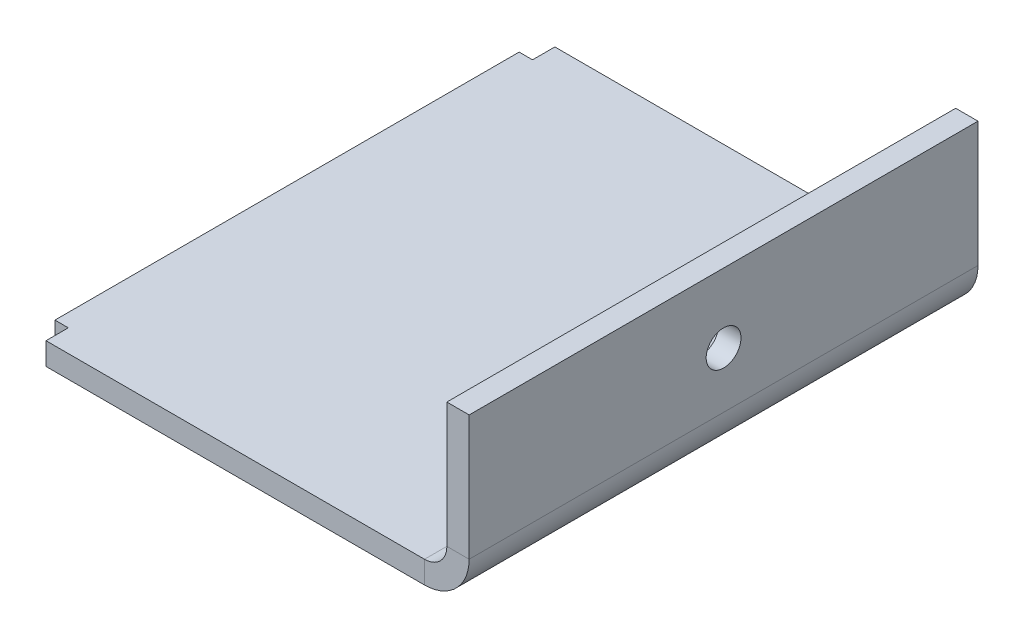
ISO-10303-21;
HEADER;
FILE_DESCRIPTION(('STEP AP214'),'2;1');
FILE_NAME('part.step','',(''),(''),'','','');
FILE_SCHEMA(('AUTOMOTIVE_DESIGN { 1 0 10303 214 1 1 1 1 }'));
ENDSEC;
DATA;
#1=APPLICATION_CONTEXT('core data for automotive mechanical design processes');
#2=APPLICATION_PROTOCOL_DEFINITION('international standard','automotive_design',2000,#1);
#3=PRODUCT_CONTEXT('',#1,'mechanical');
#4=PRODUCT('Part','Part','',(#3));
#5=PRODUCT_RELATED_PRODUCT_CATEGORY('part','',(#4));
#6=PRODUCT_DEFINITION_FORMATION('','',#4);
#7=PRODUCT_DEFINITION_CONTEXT('part definition',#1,'design');
#8=PRODUCT_DEFINITION('design','',#6,#7);
#9=PRODUCT_DEFINITION_SHAPE('','',#8);
#10=(LENGTH_UNIT() NAMED_UNIT(*) SI_UNIT(.MILLI.,.METRE.));
#11=(NAMED_UNIT(*) PLANE_ANGLE_UNIT() SI_UNIT($,.RADIAN.));
#12=(NAMED_UNIT(*) SI_UNIT($,.STERADIAN.) SOLID_ANGLE_UNIT());
#13=UNCERTAINTY_MEASURE_WITH_UNIT(LENGTH_MEASURE(1.E-05),#10,'distance_accuracy_value','');
#14=(GEOMETRIC_REPRESENTATION_CONTEXT(3) GLOBAL_UNCERTAINTY_ASSIGNED_CONTEXT((#13)) GLOBAL_UNIT_ASSIGNED_CONTEXT((#10,
#11,#12)) REPRESENTATION_CONTEXT('',''));
#15=CARTESIAN_POINT('',(0.,0.,0.));
#16=DIRECTION('',(0.,0.,1.));
#17=DIRECTION('',(1.,0.,0.));
#18=AXIS2_PLACEMENT_3D('',#15,#16,#17);
#19=CARTESIAN_POINT('',(97.8,5.,0.));
#20=DIRECTION('',(0.,0.,-1.));
#21=DIRECTION('',(-1.,0.,0.));
#22=AXIS2_PLACEMENT_3D('',#19,#20,#21);
#23=PLANE('',#22);
#24=DIRECTION('',(1.,0.,0.));
#25=VECTOR('',#24,1.);
#26=CARTESIAN_POINT('',(0.,-5.,0.));
#27=LINE('',#26,#25);
#28=CARTESIAN_POINT('',(3.,-5.,0.));
#29=VERTEX_POINT('',#28);
#30=CARTESIAN_POINT('',(87.8,-5.,0.));
#31=VERTEX_POINT('',#30);
#32=EDGE_CURVE('E221',#29,#31,#27,.T.);
#33=ORIENTED_EDGE('',*,*,#32,.F.);
#34=DIRECTION('',(0.,-1.,0.));
#35=VECTOR('',#34,1.);
#36=CARTESIAN_POINT('',(3.,199.918692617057,0.));
#37=LINE('',#36,#35);
#38=CARTESIAN_POINT('',(3.,0.,0.));
#39=VERTEX_POINT('',#38);
#40=EDGE_CURVE('E169',#39,#29,#37,.T.);
#41=ORIENTED_EDGE('',*,*,#40,.F.);
#42=DIRECTION('',(1.,0.,0.));
#43=VECTOR('',#42,1.);
#44=CARTESIAN_POINT('',(0.,0.,0.));
#45=LINE('',#44,#43);
#46=CARTESIAN_POINT('',(87.8,0.,0.));
#47=VERTEX_POINT('',#46);
#48=EDGE_CURVE('E219',#39,#47,#45,.T.);
#49=ORIENTED_EDGE('',*,*,#48,.T.);
#50=DIRECTION('',(0.,-1.,0.));
#51=VECTOR('',#50,1.);
#52=CARTESIAN_POINT('',(87.8,0.,0.));
#53=LINE('',#52,#51);
#54=EDGE_CURVE('E245',#47,#31,#53,.T.);
#55=ORIENTED_EDGE('',*,*,#54,.T.);
#56=EDGE_LOOP('',(#33,#41,#49,#55));
#57=FACE_BOUND('',#56,.T.);
#58=ADVANCED_FACE('F34',(#57),#23,.T.);
#59=CARTESIAN_POINT('',(0.,0.,114.));
#60=DIRECTION('',(0.,1.,0.));
#61=DIRECTION('',(0.,0.,1.));
#62=AXIS2_PLACEMENT_3D('',#59,#60,#61);
#63=PLANE('',#62);
#64=DIRECTION('',(1.,0.,0.));
#65=VECTOR('',#64,1.);
#66=CARTESIAN_POINT('',(0.,0.,109.));
#67=LINE('',#66,#65);
#68=CARTESIAN_POINT('',(0.,0.,109.));
#69=VERTEX_POINT('',#68);
#70=CARTESIAN_POINT('',(3.,0.,109.));
#71=VERTEX_POINT('',#70);
#72=EDGE_CURVE('E49',#69,#71,#67,.T.);
#73=ORIENTED_EDGE('',*,*,#72,.T.);
#74=DIRECTION('',(0.,0.,1.));
#75=VECTOR('',#74,1.);
#76=CARTESIAN_POINT('',(3.,0.,114.));
#77=LINE('',#76,#75);
#78=CARTESIAN_POINT('',(3.,0.,114.));
#79=VERTEX_POINT('',#78);
#80=EDGE_CURVE('E136',#71,#79,#77,.T.);
#81=ORIENTED_EDGE('',*,*,#80,.T.);
#82=DIRECTION('',(1.,0.,0.));
#83=VECTOR('',#82,1.);
#84=CARTESIAN_POINT('',(0.,0.,114.));
#85=LINE('',#84,#83);
#86=CARTESIAN_POINT('',(87.8,0.,114.));
#87=VERTEX_POINT('',#86);
#88=EDGE_CURVE('E124',#79,#87,#85,.T.);
#89=ORIENTED_EDGE('',*,*,#88,.T.);
#90=DIRECTION('',(0.,0.,-1.));
#91=VECTOR('',#90,1.);
#92=CARTESIAN_POINT('',(87.8,0.,114.));
#93=LINE('',#92,#91);
#94=EDGE_CURVE('E234',#87,#47,#93,.T.);
#95=ORIENTED_EDGE('',*,*,#94,.T.);
#96=ORIENTED_EDGE('',*,*,#48,.F.);
#97=DIRECTION('',(0.,0.,1.));
#98=VECTOR('',#97,1.);
#99=CARTESIAN_POINT('',(3.,0.,114.));
#100=LINE('',#99,#98);
#101=CARTESIAN_POINT('',(3.,0.,5.));
#102=VERTEX_POINT('',#101);
#103=EDGE_CURVE('E56',#39,#102,#100,.T.);
#104=ORIENTED_EDGE('',*,*,#103,.T.);
#105=DIRECTION('',(-1.,0.,0.));
#106=VECTOR('',#105,1.);
#107=CARTESIAN_POINT('',(-1.5757071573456E-13,0.,5.));
#108=LINE('',#107,#106);
#109=CARTESIAN_POINT('',(0.,0.,5.00000000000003));
#110=VERTEX_POINT('',#109);
#111=EDGE_CURVE('E182',#102,#110,#108,.T.);
#112=ORIENTED_EDGE('',*,*,#111,.T.);
#113=DIRECTION('',(0.,0.,-1.));
#114=VECTOR('',#113,1.);
#115=CARTESIAN_POINT('',(0.,0.,114.));
#116=LINE('',#115,#114);
#117=EDGE_CURVE('E231',#69,#110,#116,.T.);
#118=ORIENTED_EDGE('',*,*,#117,.F.);
#119=EDGE_LOOP('',(#73,#81,#89,#95,#96,#104,#112,#118));
#120=FACE_BOUND('',#119,.T.);
#121=ADVANCED_FACE('F137',(#120),#63,.T.);
#122=CARTESIAN_POINT('',(0.,-5.,114.));
#123=DIRECTION('',(-1.,0.,0.));
#124=DIRECTION('',(0.,0.,1.));
#125=AXIS2_PLACEMENT_3D('',#122,#123,#124);
#126=PLANE('',#125);
#127=DIRECTION('',(0.,-1.,0.));
#128=VECTOR('',#127,1.);
#129=CARTESIAN_POINT('',(0.,199.918692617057,109.));
#130=LINE('',#129,#128);
#131=CARTESIAN_POINT('',(0.,-5.,109.));
#132=VERTEX_POINT('',#131);
#133=EDGE_CURVE('E172',#69,#132,#130,.T.);
#134=ORIENTED_EDGE('',*,*,#133,.F.);
#135=ORIENTED_EDGE('',*,*,#117,.T.);
#136=DIRECTION('',(0.,-1.,0.));
#137=VECTOR('',#136,1.);
#138=CARTESIAN_POINT('',(0.,199.918692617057,5.));
#139=LINE('',#138,#137);
#140=CARTESIAN_POINT('',(0.,-5.,5.00000000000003));
#141=VERTEX_POINT('',#140);
#142=EDGE_CURVE('E157',#110,#141,#139,.T.);
#143=ORIENTED_EDGE('',*,*,#142,.T.);
#144=DIRECTION('',(0.,0.,-1.));
#145=VECTOR('',#144,1.);
#146=CARTESIAN_POINT('',(0.,-5.,114.));
#147=LINE('',#146,#145);
#148=EDGE_CURVE('E165',#132,#141,#147,.T.);
#149=ORIENTED_EDGE('',*,*,#148,.F.);
#150=EDGE_LOOP('',(#134,#135,#143,#149));
#151=FACE_BOUND('',#150,.T.);
#152=ADVANCED_FACE('F290',(#151),#126,.T.);
#153=CARTESIAN_POINT('',(0.,-5.,114.));
#154=DIRECTION('',(0.,1.,0.));
#155=DIRECTION('',(0.,0.,1.));
#156=AXIS2_PLACEMENT_3D('',#153,#154,#155);
#157=PLANE('',#156);
#158=DIRECTION('',(0.,0.,1.));
#159=VECTOR('',#158,1.);
#160=CARTESIAN_POINT('',(3.,-5.,114.));
#161=LINE('',#160,#159);
#162=CARTESIAN_POINT('',(3.,-5.,109.));
#163=VERTEX_POINT('',#162);
#164=CARTESIAN_POINT('',(3.,-5.,114.));
#165=VERTEX_POINT('',#164);
#166=EDGE_CURVE('E141',#163,#165,#161,.T.);
#167=ORIENTED_EDGE('',*,*,#166,.F.);
#168=DIRECTION('',(1.,0.,0.));
#169=VECTOR('',#168,1.);
#170=CARTESIAN_POINT('',(0.,-5.,109.));
#171=LINE('',#170,#169);
#172=EDGE_CURVE('E11',#132,#163,#171,.T.);
#173=ORIENTED_EDGE('',*,*,#172,.F.);
#174=ORIENTED_EDGE('',*,*,#148,.T.);
#175=DIRECTION('',(-1.,0.,0.));
#176=VECTOR('',#175,1.);
#177=CARTESIAN_POINT('',(-1.5757071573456E-13,-5.,5.));
#178=LINE('',#177,#176);
#179=CARTESIAN_POINT('',(3.,-5.,5.));
#180=VERTEX_POINT('',#179);
#181=EDGE_CURVE('E42',#180,#141,#178,.T.);
#182=ORIENTED_EDGE('',*,*,#181,.F.);
#183=DIRECTION('',(0.,0.,1.));
#184=VECTOR('',#183,1.);
#185=CARTESIAN_POINT('',(3.,-5.,114.));
#186=LINE('',#185,#184);
#187=EDGE_CURVE('E145',#29,#180,#186,.T.);
#188=ORIENTED_EDGE('',*,*,#187,.F.);
#189=ORIENTED_EDGE('',*,*,#32,.T.);
#190=DIRECTION('',(0.,0.,-1.));
#191=VECTOR('',#190,1.);
#192=CARTESIAN_POINT('',(87.8,-5.,114.));
#193=LINE('',#192,#191);
#194=CARTESIAN_POINT('',(87.8,-5.,114.));
#195=VERTEX_POINT('',#194);
#196=EDGE_CURVE('E227',#195,#31,#193,.T.);
#197=ORIENTED_EDGE('',*,*,#196,.F.);
#198=DIRECTION('',(1.,0.,0.));
#199=VECTOR('',#198,1.);
#200=CARTESIAN_POINT('',(0.,-5.,114.));
#201=LINE('',#200,#199);
#202=EDGE_CURVE('E133',#165,#195,#201,.T.);
#203=ORIENTED_EDGE('',*,*,#202,.F.);
#204=EDGE_LOOP('',(#167,#173,#174,#182,#188,#189,#197,#203));
#205=FACE_BOUND('',#204,.T.);
#206=ADVANCED_FACE('F162',(#205),#157,.F.);
#207=CARTESIAN_POINT('',(87.8,5.,114.));
#208=DIRECTION('',(0.,0.,-1.));
#209=DIRECTION('',(-1.,0.,0.));
#210=AXIS2_PLACEMENT_3D('',#207,#208,#209);
#211=PLANE('',#210);
#212=DIRECTION('',(0.,1.,0.));
#213=VECTOR('',#212,1.);
#214=CARTESIAN_POINT('',(3.,5.,114.));
#215=LINE('',#214,#213);
#216=EDGE_CURVE('E127',#165,#79,#215,.T.);
#217=ORIENTED_EDGE('',*,*,#216,.F.);
#218=ORIENTED_EDGE('',*,*,#202,.T.);
#219=DIRECTION('',(0.,1.,0.));
#220=VECTOR('',#219,1.);
#221=CARTESIAN_POINT('',(87.8,-5.,114.));
#222=LINE('',#221,#220);
#223=EDGE_CURVE('E130',#195,#87,#222,.T.);
#224=ORIENTED_EDGE('',*,*,#223,.T.);
#225=ORIENTED_EDGE('',*,*,#88,.F.);
#226=EDGE_LOOP('',(#217,#218,#224,#225));
#227=FACE_BOUND('',#226,.T.);
#228=ADVANCED_FACE('F125',(#227),#211,.F.);
#229=CARTESIAN_POINT('',(92.8,5.,114.));
#230=DIRECTION('',(0.,0.,1.));
#231=DIRECTION('',(1.,0.,0.));
#232=AXIS2_PLACEMENT_3D('',#229,#230,#231);
#233=PLANE('',#232);
#234=DIRECTION('',(1.,0.,0.));
#235=VECTOR('',#234,1.);
#236=CARTESIAN_POINT('',(92.8,5.,114.));
#237=LINE('',#236,#235);
#238=CARTESIAN_POINT('',(92.8,5.,114.));
#239=VERTEX_POINT('',#238);
#240=CARTESIAN_POINT('',(97.8,5.,114.));
#241=VERTEX_POINT('',#240);
#242=EDGE_CURVE('E146',#239,#241,#237,.T.);
#243=ORIENTED_EDGE('',*,*,#242,.F.);
#244=CARTESIAN_POINT('',(87.8,5.,114.));
#245=DIRECTION('',(0.,0.,-1.));
#246=DIRECTION('',(-1.,0.,0.));
#247=AXIS2_PLACEMENT_3D('',#244,#245,#246);
#248=CIRCLE('',#247,5.);
#249=EDGE_CURVE('E134',#87,#239,#248,.F.);
#250=ORIENTED_EDGE('',*,*,#249,.F.);
#251=ORIENTED_EDGE('',*,*,#223,.F.);
#252=CARTESIAN_POINT('',(87.8,5.,114.));
#253=DIRECTION('',(0.,0.,1.));
#254=DIRECTION('',(1.,0.,0.));
#255=AXIS2_PLACEMENT_3D('',#252,#253,#254);
#256=CIRCLE('',#255,10.);
#257=EDGE_CURVE('E204',#195,#241,#256,.T.);
#258=ORIENTED_EDGE('',*,*,#257,.T.);
#259=EDGE_LOOP('',(#243,#250,#251,#258));
#260=FACE_BOUND('',#259,.T.);
#261=ADVANCED_FACE('F36',(#260),#233,.T.);
#262=CARTESIAN_POINT('',(87.8,-5.,114.));
#263=DIRECTION('',(0.,0.,1.));
#264=DIRECTION('',(1.,0.,0.));
#265=AXIS2_PLACEMENT_3D('',#262,#263,#264);
#266=PLANE('',#265);
#267=DIRECTION('',(0.,1.,0.));
#268=VECTOR('',#267,1.);
#269=CARTESIAN_POINT('',(92.8,0.,114.));
#270=LINE('',#269,#268);
#271=CARTESIAN_POINT('',(92.8,33.,114.));
#272=VERTEX_POINT('',#271);
#273=EDGE_CURVE('E198',#239,#272,#270,.T.);
#274=ORIENTED_EDGE('',*,*,#273,.F.);
#275=ORIENTED_EDGE('',*,*,#242,.T.);
#276=DIRECTION('',(0.,1.,0.));
#277=VECTOR('',#276,1.);
#278=CARTESIAN_POINT('',(97.8,0.,114.));
#279=LINE('',#278,#277);
#280=CARTESIAN_POINT('',(97.8,33.,114.));
#281=VERTEX_POINT('',#280);
#282=EDGE_CURVE('E192',#241,#281,#279,.T.);
#283=ORIENTED_EDGE('',*,*,#282,.T.);
#284=DIRECTION('',(1.,0.,0.));
#285=VECTOR('',#284,1.);
#286=CARTESIAN_POINT('',(92.8,33.,114.));
#287=LINE('',#286,#285);
#288=EDGE_CURVE('E194',#272,#281,#287,.T.);
#289=ORIENTED_EDGE('',*,*,#288,.F.);
#290=EDGE_LOOP('',(#274,#275,#283,#289));
#291=FACE_BOUND('',#290,.T.);
#292=ADVANCED_FACE('F277',(#291),#266,.T.);
#293=CARTESIAN_POINT('',(87.8,0.,0.));
#294=DIRECTION('',(0.,0.,-1.));
#295=DIRECTION('',(-1.,0.,0.));
#296=AXIS2_PLACEMENT_3D('',#293,#294,#295);
#297=PLANE('',#296);
#298=ORIENTED_EDGE('',*,*,#54,.F.);
#299=CARTESIAN_POINT('',(87.8,5.,0.));
#300=DIRECTION('',(0.,0.,-1.));
#301=DIRECTION('',(-1.,0.,0.));
#302=AXIS2_PLACEMENT_3D('',#299,#300,#301);
#303=CIRCLE('',#302,5.);
#304=CARTESIAN_POINT('',(92.8,5.,0.));
#305=VERTEX_POINT('',#304);
#306=EDGE_CURVE('E216',#47,#305,#303,.F.);
#307=ORIENTED_EDGE('',*,*,#306,.T.);
#308=DIRECTION('',(-1.,0.,0.));
#309=VECTOR('',#308,1.);
#310=CARTESIAN_POINT('',(97.8,5.,0.));
#311=LINE('',#310,#309);
#312=CARTESIAN_POINT('',(97.8,5.,0.));
#313=VERTEX_POINT('',#312);
#314=EDGE_CURVE('E243',#313,#305,#311,.T.);
#315=ORIENTED_EDGE('',*,*,#314,.F.);
#316=CARTESIAN_POINT('',(87.8,5.,0.));
#317=DIRECTION('',(0.,0.,1.));
#318=DIRECTION('',(1.,0.,0.));
#319=AXIS2_PLACEMENT_3D('',#316,#317,#318);
#320=CIRCLE('',#319,10.);
#321=EDGE_CURVE('E195',#31,#313,#320,.T.);
#322=ORIENTED_EDGE('',*,*,#321,.F.);
#323=EDGE_LOOP('',(#298,#307,#315,#322));
#324=FACE_BOUND('',#323,.T.);
#325=ADVANCED_FACE('F255',(#324),#297,.T.);
#326=CARTESIAN_POINT('',(97.8,0.,114.));
#327=DIRECTION('',(-1.,0.,0.));
#328=DIRECTION('',(0.,0.,1.));
#329=AXIS2_PLACEMENT_3D('',#326,#327,#328);
#330=PLANE('',#329);
#331=CARTESIAN_POINT('',(97.8,17.5,57.));
#332=DIRECTION('',(1.,0.,0.));
#333=DIRECTION('',(0.,0.,-1.));
#334=AXIS2_PLACEMENT_3D('',#331,#332,#333);
#335=CIRCLE('',#334,3.9);
#336=CARTESIAN_POINT('',(97.8,17.5,53.1));
#337=VERTEX_POINT('',#336);
#338=EDGE_CURVE('E185',#337,#337,#335,.T.);
#339=ORIENTED_EDGE('',*,*,#338,.F.);
#340=EDGE_LOOP('',(#339));
#341=FACE_BOUND('',#340,.T.);
#342=DIRECTION('',(0.,1.,0.));
#343=VECTOR('',#342,1.);
#344=CARTESIAN_POINT('',(97.8,0.,0.));
#345=LINE('',#344,#343);
#346=CARTESIAN_POINT('',(97.8,33.,0.));
#347=VERTEX_POINT('',#346);
#348=EDGE_CURVE('E189',#313,#347,#345,.T.);
#349=ORIENTED_EDGE('',*,*,#348,.T.);
#350=DIRECTION('',(0.,0.,-1.));
#351=VECTOR('',#350,1.);
#352=CARTESIAN_POINT('',(97.8,33.,114.));
#353=LINE('',#352,#351);
#354=EDGE_CURVE('E241',#281,#347,#353,.T.);
#355=ORIENTED_EDGE('',*,*,#354,.F.);
#356=ORIENTED_EDGE('',*,*,#282,.F.);
#357=DIRECTION('',(0.,0.,-1.));
#358=VECTOR('',#357,1.);
#359=CARTESIAN_POINT('',(97.8,5.,114.));
#360=LINE('',#359,#358);
#361=EDGE_CURVE('E207',#241,#313,#360,.T.);
#362=ORIENTED_EDGE('',*,*,#361,.T.);
#363=EDGE_LOOP('',(#349,#355,#356,#362));
#364=FACE_BOUND('',#363,.T.);
#365=ADVANCED_FACE('F275',(#341,#364),#330,.F.);
#366=CARTESIAN_POINT('',(92.8,33.,114.));
#367=DIRECTION('',(0.,1.,0.));
#368=DIRECTION('',(0.,0.,1.));
#369=AXIS2_PLACEMENT_3D('',#366,#367,#368);
#370=PLANE('',#369);
#371=DIRECTION('',(1.,0.,0.));
#372=VECTOR('',#371,1.);
#373=CARTESIAN_POINT('',(92.8,33.,0.));
#374=LINE('',#373,#372);
#375=CARTESIAN_POINT('',(92.8,33.,0.));
#376=VERTEX_POINT('',#375);
#377=EDGE_CURVE('E210',#376,#347,#374,.T.);
#378=ORIENTED_EDGE('',*,*,#377,.F.);
#379=DIRECTION('',(0.,0.,-1.));
#380=VECTOR('',#379,1.);
#381=CARTESIAN_POINT('',(92.8,33.,114.));
#382=LINE('',#381,#380);
#383=EDGE_CURVE('E239',#272,#376,#382,.T.);
#384=ORIENTED_EDGE('',*,*,#383,.F.);
#385=ORIENTED_EDGE('',*,*,#288,.T.);
#386=ORIENTED_EDGE('',*,*,#354,.T.);
#387=EDGE_LOOP('',(#378,#384,#385,#386));
#388=FACE_BOUND('',#387,.T.);
#389=ADVANCED_FACE('F271',(#388),#370,.T.);
#390=CARTESIAN_POINT('',(92.8,0.,114.));
#391=DIRECTION('',(-1.,0.,0.));
#392=DIRECTION('',(0.,0.,1.));
#393=AXIS2_PLACEMENT_3D('',#390,#391,#392);
#394=PLANE('',#393);
#395=CARTESIAN_POINT('',(92.8,17.5,57.));
#396=DIRECTION('',(1.,0.,0.));
#397=DIRECTION('',(0.,0.,-1.));
#398=AXIS2_PLACEMENT_3D('',#395,#396,#397);
#399=CIRCLE('',#398,3.9);
#400=CARTESIAN_POINT('',(92.8,17.5,53.1));
#401=VERTEX_POINT('',#400);
#402=EDGE_CURVE('E186',#401,#401,#399,.T.);
#403=ORIENTED_EDGE('',*,*,#402,.T.);
#404=EDGE_LOOP('',(#403));
#405=FACE_BOUND('',#404,.T.);
#406=DIRECTION('',(0.,1.,0.));
#407=VECTOR('',#406,1.);
#408=CARTESIAN_POINT('',(92.8,0.,0.));
#409=LINE('',#408,#407);
#410=EDGE_CURVE('E213',#305,#376,#409,.T.);
#411=ORIENTED_EDGE('',*,*,#410,.F.);
#412=DIRECTION('',(0.,0.,-1.));
#413=VECTOR('',#412,1.);
#414=CARTESIAN_POINT('',(92.8,5.,114.));
#415=LINE('',#414,#413);
#416=EDGE_CURVE('E236',#239,#305,#415,.T.);
#417=ORIENTED_EDGE('',*,*,#416,.F.);
#418=ORIENTED_EDGE('',*,*,#273,.T.);
#419=ORIENTED_EDGE('',*,*,#383,.T.);
#420=EDGE_LOOP('',(#411,#417,#418,#419));
#421=FACE_BOUND('',#420,.T.);
#422=ADVANCED_FACE('F267',(#405,#421),#394,.T.);
#423=CARTESIAN_POINT('',(87.8,5.,114.));
#424=DIRECTION('',(0.,0.,-1.));
#425=DIRECTION('',(-1.,0.,0.));
#426=AXIS2_PLACEMENT_3D('',#423,#424,#425);
#427=CYLINDRICAL_SURFACE('',#426,5.);
#428=ORIENTED_EDGE('',*,*,#306,.F.);
#429=ORIENTED_EDGE('',*,*,#94,.F.);
#430=ORIENTED_EDGE('',*,*,#249,.T.);
#431=ORIENTED_EDGE('',*,*,#416,.T.);
#432=EDGE_LOOP('',(#428,#429,#430,#431));
#433=FACE_BOUND('',#432,.T.);
#434=ADVANCED_FACE('F263',(#433),#427,.F.);
#435=CARTESIAN_POINT('',(87.8,5.,114.));
#436=DIRECTION('',(0.,0.,-1.));
#437=DIRECTION('',(-1.,0.,0.));
#438=AXIS2_PLACEMENT_3D('',#435,#436,#437);
#439=CYLINDRICAL_SURFACE('',#438,10.);
#440=ORIENTED_EDGE('',*,*,#321,.T.);
#441=ORIENTED_EDGE('',*,*,#361,.F.);
#442=ORIENTED_EDGE('',*,*,#257,.F.);
#443=ORIENTED_EDGE('',*,*,#196,.T.);
#444=EDGE_LOOP('',(#440,#441,#442,#443));
#445=FACE_BOUND('',#444,.T.);
#446=ADVANCED_FACE('F253',(#445),#439,.T.);
#447=CARTESIAN_POINT('',(87.8,5.,0.));
#448=DIRECTION('',(0.,0.,-1.));
#449=DIRECTION('',(-1.,0.,0.));
#450=AXIS2_PLACEMENT_3D('',#447,#448,#449);
#451=PLANE('',#450);
#452=ORIENTED_EDGE('',*,*,#348,.F.);
#453=ORIENTED_EDGE('',*,*,#314,.T.);
#454=ORIENTED_EDGE('',*,*,#410,.T.);
#455=ORIENTED_EDGE('',*,*,#377,.T.);
#456=EDGE_LOOP('',(#452,#453,#454,#455));
#457=FACE_BOUND('',#456,.T.);
#458=ADVANCED_FACE('F259',(#457),#451,.T.);
#459=CARTESIAN_POINT('',(92.8,17.5,57.));
#460=DIRECTION('',(1.,0.,0.));
#461=DIRECTION('',(0.,0.,-1.));
#462=AXIS2_PLACEMENT_3D('',#459,#460,#461);
#463=CYLINDRICAL_SURFACE('',#462,3.9);
#464=ORIENTED_EDGE('',*,*,#402,.F.);
#465=EDGE_LOOP('',(#464));
#466=FACE_BOUND('',#465,.T.);
#467=ORIENTED_EDGE('',*,*,#338,.T.);
#468=EDGE_LOOP('',(#467));
#469=FACE_BOUND('',#468,.T.);
#470=ADVANCED_FACE('F305',(#466,#469),#463,.F.);
#471=CARTESIAN_POINT('',(3.,199.918692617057,114.));
#472=DIRECTION('',(-1.,0.,0.));
#473=DIRECTION('',(0.,0.,1.));
#474=AXIS2_PLACEMENT_3D('',#471,#472,#473);
#475=PLANE('',#474);
#476=ORIENTED_EDGE('',*,*,#80,.F.);
#477=DIRECTION('',(0.,-1.,0.));
#478=VECTOR('',#477,1.);
#479=CARTESIAN_POINT('',(3.,199.918692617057,109.));
#480=LINE('',#479,#478);
#481=EDGE_CURVE('E178',#71,#163,#480,.T.);
#482=ORIENTED_EDGE('',*,*,#481,.T.);
#483=ORIENTED_EDGE('',*,*,#166,.T.);
#484=ORIENTED_EDGE('',*,*,#216,.T.);
#485=EDGE_LOOP('',(#476,#482,#483,#484));
#486=FACE_BOUND('',#485,.T.);
#487=ADVANCED_FACE('F144',(#486),#475,.T.);
#488=CARTESIAN_POINT('',(3.,199.918692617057,109.));
#489=DIRECTION('',(0.,0.,1.));
#490=DIRECTION('',(1.,0.,0.));
#491=AXIS2_PLACEMENT_3D('',#488,#489,#490);
#492=PLANE('',#491);
#493=ORIENTED_EDGE('',*,*,#72,.F.);
#494=ORIENTED_EDGE('',*,*,#133,.T.);
#495=ORIENTED_EDGE('',*,*,#172,.T.);
#496=ORIENTED_EDGE('',*,*,#481,.F.);
#497=EDGE_LOOP('',(#493,#494,#495,#496));
#498=FACE_BOUND('',#497,.T.);
#499=ADVANCED_FACE('F313',(#498),#492,.T.);
#500=CARTESIAN_POINT('',(0.,199.918692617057,5.));
#501=DIRECTION('',(0.,0.,-1.));
#502=DIRECTION('',(-1.,0.,0.));
#503=AXIS2_PLACEMENT_3D('',#500,#501,#502);
#504=PLANE('',#503);
#505=ORIENTED_EDGE('',*,*,#111,.F.);
#506=DIRECTION('',(0.,-1.,0.));
#507=VECTOR('',#506,1.);
#508=CARTESIAN_POINT('',(3.,199.918692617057,5.));
#509=LINE('',#508,#507);
#510=EDGE_CURVE('E159',#102,#180,#509,.T.);
#511=ORIENTED_EDGE('',*,*,#510,.T.);
#512=ORIENTED_EDGE('',*,*,#181,.T.);
#513=ORIENTED_EDGE('',*,*,#142,.F.);
#514=EDGE_LOOP('',(#505,#511,#512,#513));
#515=FACE_BOUND('',#514,.T.);
#516=ADVANCED_FACE('F156',(#515),#504,.T.);
#517=CARTESIAN_POINT('',(3.,199.918692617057,5.));
#518=DIRECTION('',(-1.,0.,0.));
#519=DIRECTION('',(0.,0.,1.));
#520=AXIS2_PLACEMENT_3D('',#517,#518,#519);
#521=PLANE('',#520);
#522=ORIENTED_EDGE('',*,*,#103,.F.);
#523=ORIENTED_EDGE('',*,*,#40,.T.);
#524=ORIENTED_EDGE('',*,*,#187,.T.);
#525=ORIENTED_EDGE('',*,*,#510,.F.);
#526=EDGE_LOOP('',(#522,#523,#524,#525));
#527=FACE_BOUND('',#526,.T.);
#528=ADVANCED_FACE('F168',(#527),#521,.T.);
#529=CLOSED_SHELL('',(#58,#121,#152,#206,#228,#261,#292,#325,#365,#389,#422,#434,#446,#458,#470,
#487,#499,#516,#528));
#530=MANIFOLD_SOLID_BREP('B2',#529);
#531=ADVANCED_BREP_SHAPE_REPRESENTATION('',(#18,#530),#14);
#532=SHAPE_DEFINITION_REPRESENTATION(#9,#531);
ENDSEC;
END-ISO-10303-21;
